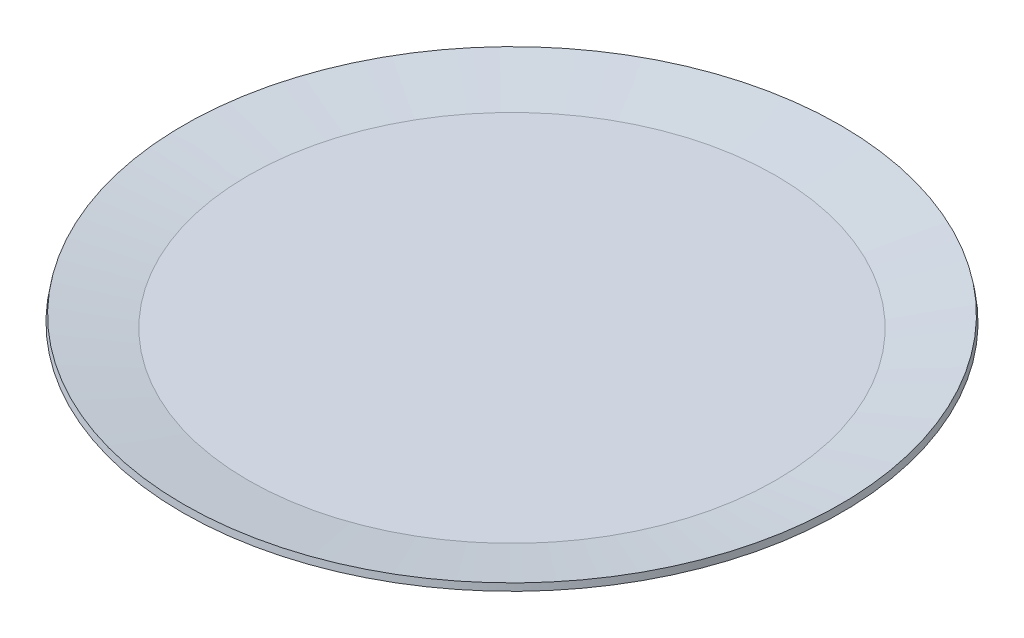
from build123d import *


with BuildPart() as part:
    # Sketch2 → Revolve1 (revolve)
    with BuildSketch(Plane.XY, mode=Mode.PRIVATE) as revolve1_sk:
        with BuildLine():
            ThreePointArc((40.086159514, 0.015192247), (39.999667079, 0.003805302), (39.912511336, 0))
            Line((39.912511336, 0), (0, 0))
            Line((0, 0), (0, 1))
            Line((0, 1), (39.912511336, 1))
            Line((39.912511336, 1), (49.674429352, 2.72128953))
            Line((49.674429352, 2.72128953), (49.84807753, 1.736481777))
            Line((49.84807753, 1.736481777), (40.086159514, 0.015192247))
        make_face()
    revolve(revolve1_sk.sketch.rotate(Axis((0, 1, 0), (0, -1, 0)), 90), axis=Axis((0, 1, 0), (0, -1, 0)))


solid = part.part
